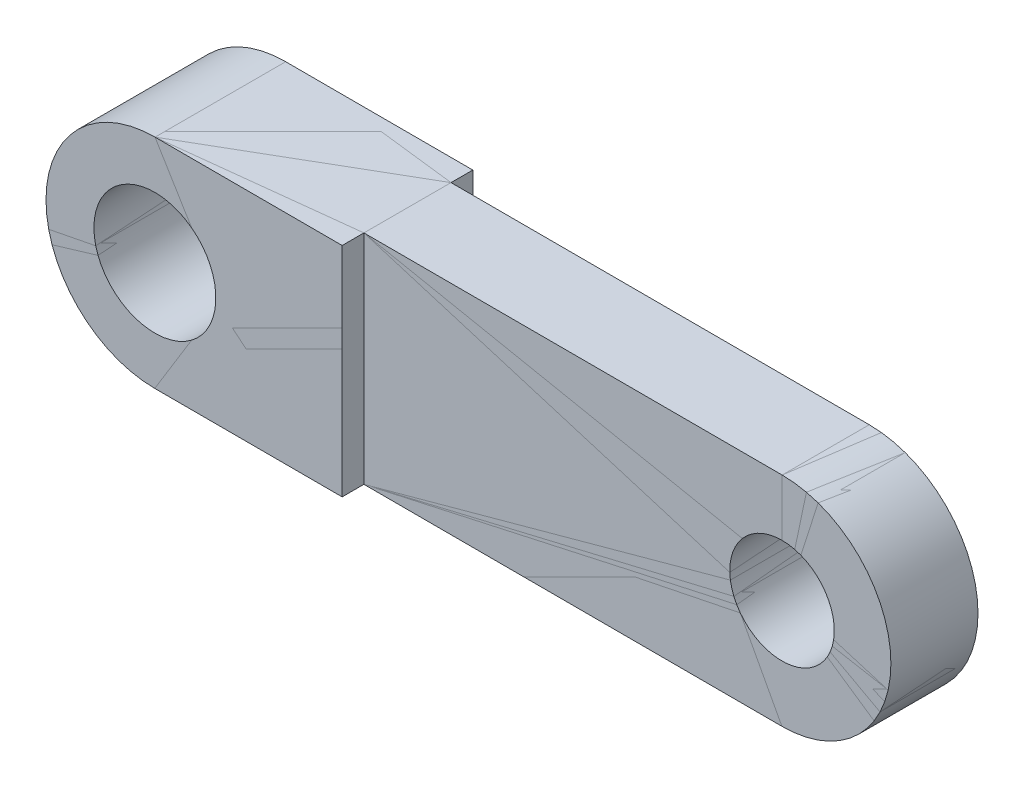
ISO-10303-21;
HEADER;
FILE_DESCRIPTION(('STEP AP214'),'2;1');
FILE_NAME('part.step','',(''),(''),'','','');
FILE_SCHEMA(('AUTOMOTIVE_DESIGN { 1 0 10303 214 1 1 1 1 }'));
ENDSEC;
DATA;
#1=APPLICATION_CONTEXT('core data for automotive mechanical design processes');
#2=APPLICATION_PROTOCOL_DEFINITION('international standard','automotive_design',2000,#1);
#3=PRODUCT_CONTEXT('',#1,'mechanical');
#4=PRODUCT('Part','Part','',(#3));
#5=PRODUCT_RELATED_PRODUCT_CATEGORY('part','',(#4));
#6=PRODUCT_DEFINITION_FORMATION('','',#4);
#7=PRODUCT_DEFINITION_CONTEXT('part definition',#1,'design');
#8=PRODUCT_DEFINITION('design','',#6,#7);
#9=PRODUCT_DEFINITION_SHAPE('','',#8);
#10=(LENGTH_UNIT() NAMED_UNIT(*) SI_UNIT(.MILLI.,.METRE.));
#11=(NAMED_UNIT(*) PLANE_ANGLE_UNIT() SI_UNIT($,.RADIAN.));
#12=(NAMED_UNIT(*) SI_UNIT($,.STERADIAN.) SOLID_ANGLE_UNIT());
#13=UNCERTAINTY_MEASURE_WITH_UNIT(LENGTH_MEASURE(1.E-05),#10,'distance_accuracy_value','');
#14=(GEOMETRIC_REPRESENTATION_CONTEXT(3) GLOBAL_UNCERTAINTY_ASSIGNED_CONTEXT((#13)) GLOBAL_UNIT_ASSIGNED_CONTEXT((#10,
#11,#12)) REPRESENTATION_CONTEXT('',''));
#15=CARTESIAN_POINT('',(0.,0.,0.));
#16=DIRECTION('',(0.,0.,1.));
#17=DIRECTION('',(1.,0.,0.));
#18=AXIS2_PLACEMENT_3D('',#15,#16,#17);
#19=CARTESIAN_POINT('',(-5.5,-0.094581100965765,-2.5));
#20=DIRECTION('',(0.,0.,-1.));
#21=DIRECTION('',(0.,1.,0.));
#22=AXIS2_PLACEMENT_3D('',#19,#20,#21);
#23=CYLINDRICAL_SURFACE('',#22,6.);
#24=CARTESIAN_POINT('',(-5.5,-0.0945811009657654,-12.5));
#25=DIRECTION('',(0.,0.,-1.));
#26=DIRECTION('',(0.,1.,0.));
#27=AXIS2_PLACEMENT_3D('',#24,#25,#26);
#28=CIRCLE('',#27,6.);
#29=CARTESIAN_POINT('',(-5.5,5.90541889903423,-12.5));
#30=VERTEX_POINT('',#29);
#31=EDGE_CURVE('P0_E352',#30,#30,#28,.T.);
#32=ORIENTED_EDGE('',*,*,#31,.T.);
#33=EDGE_LOOP('',(#32));
#34=FACE_BOUND('',#33,.T.);
#35=CARTESIAN_POINT('',(-5.5,-0.094581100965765,-2.5));
#36=DIRECTION('',(0.,0.,-1.));
#37=DIRECTION('',(0.,1.,0.));
#38=AXIS2_PLACEMENT_3D('',#35,#36,#37);
#39=CIRCLE('',#38,6.);
#40=CARTESIAN_POINT('',(-5.5,5.90541889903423,-2.5));
#41=VERTEX_POINT('',#40);
#42=EDGE_CURVE('P0_E430',#41,#41,#39,.F.);
#43=ORIENTED_EDGE('',*,*,#42,.T.);
#44=EDGE_LOOP('',(#43));
#45=FACE_BOUND('',#44,.T.);
#46=ADVANCED_FACE('P0_F348',(#34,#45),#23,.F.);
#47=CARTESIAN_POINT('',(-53.5,-12.529270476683,-15.));
#48=DIRECTION('',(-1.,0.,0.));
#49=DIRECTION('',(0.,0.,1.));
#50=AXIS2_PLACEMENT_3D('',#47,#48,#49);
#51=PLANE('',#50);
#52=DIRECTION('',(0.,-1.,0.));
#53=VECTOR('',#52,1.);
#54=CARTESIAN_POINT('',(-53.5,-17.779247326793,-12.5));
#55=LINE('',#54,#53);
#56=CARTESIAN_POINT('',(-53.5000000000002,12.4707526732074,-12.5000000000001));
#57=VERTEX_POINT('',#56);
#58=CARTESIAN_POINT('',(-53.4999999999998,-12.5292704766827,-12.5000000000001));
#59=VERTEX_POINT('',#58);
#60=EDGE_CURVE('P0_E408',#57,#59,#55,.T.);
#61=ORIENTED_EDGE('',*,*,#60,.T.);
#62=DIRECTION('',(0.,0.,1.));
#63=VECTOR('',#62,1.);
#64=CARTESIAN_POINT('',(-53.4999999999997,-12.5292704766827,-34.750032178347));
#65=LINE('',#64,#63);
#66=CARTESIAN_POINT('',(-53.4999999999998,-12.5292704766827,-15.0000000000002));
#67=VERTEX_POINT('',#66);
#68=EDGE_CURVE('P0_E433',#67,#59,#65,.T.);
#69=ORIENTED_EDGE('',*,*,#68,.F.);
#70=DIRECTION('',(0.,-1.,0.));
#71=VECTOR('',#70,1.);
#72=CARTESIAN_POINT('',(-53.5,-4.33,-15.));
#73=LINE('',#72,#71);
#74=CARTESIAN_POINT('',(-53.5000000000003,12.4707526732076,-15.0000000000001));
#75=VERTEX_POINT('',#74);
#76=EDGE_CURVE('P0_E415',#75,#67,#73,.T.);
#77=ORIENTED_EDGE('',*,*,#76,.F.);
#78=DIRECTION('',(0.,0.,-1.));
#79=VECTOR('',#78,1.);
#80=CARTESIAN_POINT('',(-53.5000000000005,12.4707526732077,-34.750032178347));
#81=LINE('',#80,#79);
#82=EDGE_CURVE('P0_E452',#57,#75,#81,.T.);
#83=ORIENTED_EDGE('',*,*,#82,.F.);
#84=EDGE_LOOP('',(#61,#69,#77,#83));
#85=FACE_BOUND('',#84,.T.);
#86=ADVANCED_FACE('P0_F434',(#85),#51,.F.);
#87=CARTESIAN_POINT('',(7.605,12.470752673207,-12.5));
#88=DIRECTION('',(0.,0.,1.));
#89=DIRECTION('',(-1.,0.,0.));
#90=AXIS2_PLACEMENT_3D('',#87,#88,#89);
#91=PLANE('',#90);
#92=ORIENTED_EDGE('',*,*,#31,.F.);
#93=EDGE_LOOP('',(#92));
#94=FACE_BOUND('',#93,.T.);
#95=CARTESIAN_POINT('',(-5.5,-0.094581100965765,-12.5));
#96=DIRECTION('',(0.,0.,1.));
#97=DIRECTION('',(1.,0.,0.));
#98=AXIS2_PLACEMENT_3D('',#95,#96,#97);
#99=CIRCLE('',#98,12.5000000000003);
#100=CARTESIAN_POINT('',(-5.48298902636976,12.4054073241,-12.5000000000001));
#101=VERTEX_POINT('',#100);
#102=CARTESIAN_POINT('',(-5.51701097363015,-12.594569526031,-12.5000000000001));
#103=VERTEX_POINT('',#102);
#104=EDGE_CURVE('P0_E402',#101,#103,#99,.F.);
#105=ORIENTED_EDGE('',*,*,#104,.T.);
#106=DIRECTION('',(0.999999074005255,-0.0013608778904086,0.));
#107=VECTOR('',#106,1.);
#108=CARTESIAN_POINT('',(-40.2670109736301,-12.5472789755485,-12.5000000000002));
#109=LINE('',#108,#107);
#110=EDGE_CURVE('P0_E436',#59,#103,#109,.T.);
#111=ORIENTED_EDGE('',*,*,#110,.F.);
#112=ORIENTED_EDGE('',*,*,#60,.F.);
#113=DIRECTION('',(-0.999999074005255,0.00136087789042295,0.));
#114=VECTOR('',#113,1.);
#115=CARTESIAN_POINT('',(-40.2329890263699,12.452697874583,-12.5000000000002));
#116=LINE('',#115,#114);
#117=EDGE_CURVE('P0_E456',#101,#57,#116,.T.);
#118=ORIENTED_EDGE('',*,*,#117,.F.);
#119=EDGE_LOOP('',(#105,#111,#112,#118));
#120=FACE_BOUND('',#119,.T.);
#121=ADVANCED_FACE('P0_F531',(#94,#120),#91,.F.);
#122=CARTESIAN_POINT('',(-5.5,-0.094581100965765,-12.5));
#123=DIRECTION('',(0.,0.,1.));
#124=DIRECTION('',(1.,0.,0.));
#125=AXIS2_PLACEMENT_3D('',#122,#123,#124);
#126=CYLINDRICAL_SURFACE('',#125,12.5000000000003);
#127=ORIENTED_EDGE('',*,*,#104,.F.);
#128=DIRECTION('',(0.,0.,-1.));
#129=VECTOR('',#128,1.);
#130=CARTESIAN_POINT('',(-5.4829890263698,12.4054073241,-34.750032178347));
#131=LINE('',#130,#129);
#132=CARTESIAN_POINT('',(-5.48298902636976,12.4054073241,-2.49999999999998));
#133=VERTEX_POINT('',#132);
#134=EDGE_CURVE('P0_E461',#133,#101,#131,.T.);
#135=ORIENTED_EDGE('',*,*,#134,.F.);
#136=CARTESIAN_POINT('',(-5.5,-0.094581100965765,-2.5));
#137=DIRECTION('',(0.,0.,1.));
#138=DIRECTION('',(1.,0.,0.));
#139=AXIS2_PLACEMENT_3D('',#136,#137,#138);
#140=CIRCLE('',#139,12.5000000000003);
#141=CARTESIAN_POINT('',(-5.51701097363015,-12.594569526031,-2.49999999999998));
#142=VERTEX_POINT('',#141);
#143=EDGE_CURVE('P0_E481',#133,#142,#140,.F.);
#144=ORIENTED_EDGE('',*,*,#143,.T.);
#145=DIRECTION('',(0.,0.,1.));
#146=VECTOR('',#145,1.);
#147=CARTESIAN_POINT('',(-5.5170109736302,-12.594569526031,-34.750032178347));
#148=LINE('',#147,#146);
#149=EDGE_CURVE('P0_E492',#103,#142,#148,.T.);
#150=ORIENTED_EDGE('',*,*,#149,.F.);
#151=EDGE_LOOP('',(#127,#135,#144,#150));
#152=FACE_BOUND('',#151,.T.);
#153=ADVANCED_FACE('P0_F530',(#152),#126,.T.);
#154=CARTESIAN_POINT('',(7.605,-13.199581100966,-2.5));
#155=DIRECTION('',(0.,0.,-1.));
#156=DIRECTION('',(-1.,0.,0.));
#157=AXIS2_PLACEMENT_3D('',#154,#155,#156);
#158=PLANE('',#157);
#159=ORIENTED_EDGE('',*,*,#42,.F.);
#160=EDGE_LOOP('',(#159));
#161=FACE_BOUND('',#160,.T.);
#162=DIRECTION('',(-0.999999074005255,0.0013608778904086,0.));
#163=VECTOR('',#162,1.);
#164=CARTESIAN_POINT('',(-40.2670109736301,-12.5472789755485,-2.49999999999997));
#165=LINE('',#164,#163);
#166=CARTESIAN_POINT('',(-53.5,-12.5292704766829,-2.49999999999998));
#167=VERTEX_POINT('',#166);
#168=EDGE_CURVE('P0_E495',#142,#167,#165,.T.);
#169=ORIENTED_EDGE('',*,*,#168,.F.);
#170=ORIENTED_EDGE('',*,*,#143,.F.);
#171=DIRECTION('',(0.999999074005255,-0.00136087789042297,0.));
#172=VECTOR('',#171,1.);
#173=CARTESIAN_POINT('',(-40.2329890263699,12.452697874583,-2.49999999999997));
#174=LINE('',#173,#172);
#175=CARTESIAN_POINT('',(-53.5000000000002,12.4707526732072,-2.49999999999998));
#176=VERTEX_POINT('',#175);
#177=EDGE_CURVE('P0_E429',#176,#133,#174,.T.);
#178=ORIENTED_EDGE('',*,*,#177,.F.);
#179=DIRECTION('',(0.,-1.,0.));
#180=VECTOR('',#179,1.);
#181=CARTESIAN_POINT('',(-53.5,-0.0292589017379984,-2.49999999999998));
#182=LINE('',#181,#180);
#183=EDGE_CURVE('P0_E502',#176,#167,#182,.T.);
#184=ORIENTED_EDGE('',*,*,#183,.T.);
#185=EDGE_LOOP('',(#169,#170,#178,#184));
#186=FACE_BOUND('',#185,.T.);
#187=ADVANCED_FACE('P0_F529',(#161,#186),#158,.F.);
#188=CARTESIAN_POINT('',(-87.84,12.84,-15.));
#189=DIRECTION('',(0.,0.,-1.));
#190=DIRECTION('',(1.,0.,0.));
#191=AXIS2_PLACEMENT_3D('',#188,#189,#190);
#192=PLANE('',#191);
#193=CARTESIAN_POINT('',(-75.,0.,-15.));
#194=DIRECTION('',(0.,0.,-1.));
#195=DIRECTION('',(-1.,0.,0.));
#196=AXIS2_PLACEMENT_3D('',#193,#194,#195);
#197=CIRCLE('',#196,6.99999999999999);
#198=CARTESIAN_POINT('',(-82.,0.,-15.));
#199=VERTEX_POINT('',#198);
#200=EDGE_CURVE('P0_E475',#199,#199,#197,.T.);
#201=ORIENTED_EDGE('',*,*,#200,.F.);
#202=EDGE_LOOP('',(#201));
#203=FACE_BOUND('',#202,.T.);
#204=CARTESIAN_POINT('',(-75.,0.,-15.));
#205=DIRECTION('',(0.,0.,1.));
#206=DIRECTION('',(0.,-1.,0.));
#207=AXIS2_PLACEMENT_3D('',#204,#205,#206);
#208=CIRCLE('',#207,12.5000000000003);
#209=CARTESIAN_POINT('',(-75.0170109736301,-12.499988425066,-15.0000000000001));
#210=VERTEX_POINT('',#209);
#211=CARTESIAN_POINT('',(-74.9829890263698,12.499988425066,-15.0000000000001));
#212=VERTEX_POINT('',#211);
#213=EDGE_CURVE('P0_E451',#210,#212,#208,.F.);
#214=ORIENTED_EDGE('',*,*,#213,.T.);
#215=DIRECTION('',(-0.999999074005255,0.00136087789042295,0.));
#216=VECTOR('',#215,1.);
#217=CARTESIAN_POINT('',(-40.2329890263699,12.452697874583,-15.0000000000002));
#218=LINE('',#217,#216);
#219=EDGE_CURVE('P0_E427',#75,#212,#218,.T.);
#220=ORIENTED_EDGE('',*,*,#219,.F.);
#221=ORIENTED_EDGE('',*,*,#76,.T.);
#222=DIRECTION('',(0.999999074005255,-0.00136087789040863,0.));
#223=VECTOR('',#222,1.);
#224=CARTESIAN_POINT('',(-40.2670109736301,-12.5472789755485,-15.0000000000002));
#225=LINE('',#224,#223);
#226=EDGE_CURVE('P0_E424',#210,#67,#225,.T.);
#227=ORIENTED_EDGE('',*,*,#226,.F.);
#228=EDGE_LOOP('',(#214,#220,#221,#227));
#229=FACE_BOUND('',#228,.T.);
#230=ADVANCED_FACE('P0_F422',(#203,#229),#192,.T.);
#231=CARTESIAN_POINT('',(-5.4829890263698,12.4054073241,0.));
#232=DIRECTION('',(0.00136087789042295,0.999999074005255,0.));
#233=DIRECTION('',(0.,0.,-1.));
#234=AXIS2_PLACEMENT_3D('',#231,#232,#233);
#235=PLANE('',#234);
#236=ORIENTED_EDGE('',*,*,#219,.T.);
#237=DIRECTION('',(0.,0.,1.));
#238=VECTOR('',#237,1.);
#239=CARTESIAN_POINT('',(-74.9829890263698,12.499988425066,-7.5));
#240=LINE('',#239,#238);
#241=CARTESIAN_POINT('',(-74.9829890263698,12.4999884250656,0.));
#242=VERTEX_POINT('',#241);
#243=EDGE_CURVE('P0_E441',#212,#242,#240,.T.);
#244=ORIENTED_EDGE('',*,*,#243,.T.);
#245=DIRECTION('',(-0.999999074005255,0.00136087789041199,0.));
#246=VECTOR('',#245,1.);
#247=CARTESIAN_POINT('',(-53.5,12.4707526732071,0.));
#248=LINE('',#247,#246);
#249=CARTESIAN_POINT('',(-53.5,12.4707526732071,0.));
#250=VERTEX_POINT('',#249);
#251=EDGE_CURVE('P0_E472',#250,#242,#248,.T.);
#252=ORIENTED_EDGE('',*,*,#251,.F.);
#253=DIRECTION('',(0.,0.,-1.));
#254=VECTOR('',#253,1.);
#255=CARTESIAN_POINT('',(-53.5,12.470752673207,-12.500011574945));
#256=LINE('',#255,#254);
#257=EDGE_CURVE('P0_E505',#250,#176,#256,.T.);
#258=ORIENTED_EDGE('',*,*,#257,.T.);
#259=ORIENTED_EDGE('',*,*,#177,.T.);
#260=ORIENTED_EDGE('',*,*,#134,.T.);
#261=ORIENTED_EDGE('',*,*,#117,.T.);
#262=ORIENTED_EDGE('',*,*,#82,.T.);
#263=EDGE_LOOP('',(#236,#244,#252,#258,#259,#260,#261,#262));
#264=FACE_BOUND('',#263,.T.);
#265=ADVANCED_FACE('P0_F524',(#264),#235,.T.);
#266=CARTESIAN_POINT('',(-75.,0.,-15.));
#267=DIRECTION('',(0.,0.,1.));
#268=DIRECTION('',(0.,-1.,0.));
#269=AXIS2_PLACEMENT_3D('',#266,#267,#268);
#270=CYLINDRICAL_SURFACE('',#269,12.5000000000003);
#271=ORIENTED_EDGE('',*,*,#243,.F.);
#272=ORIENTED_EDGE('',*,*,#213,.F.);
#273=DIRECTION('',(0.,0.,-1.));
#274=VECTOR('',#273,1.);
#275=CARTESIAN_POINT('',(-75.01701097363,-12.499988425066,-34.750032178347));
#276=LINE('',#275,#274);
#277=CARTESIAN_POINT('',(-75.0170109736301,-12.499988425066,0.));
#278=VERTEX_POINT('',#277);
#279=EDGE_CURVE('P0_E439',#278,#210,#276,.T.);
#280=ORIENTED_EDGE('',*,*,#279,.F.);
#281=CARTESIAN_POINT('',(-75.,0.,0.));
#282=DIRECTION('',(0.,0.,1.));
#283=DIRECTION('',(0.,-1.,0.));
#284=AXIS2_PLACEMENT_3D('',#281,#282,#283);
#285=CIRCLE('',#284,12.5000000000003);
#286=EDGE_CURVE('P0_E469',#242,#278,#285,.T.);
#287=ORIENTED_EDGE('',*,*,#286,.F.);
#288=EDGE_LOOP('',(#271,#272,#280,#287));
#289=FACE_BOUND('',#288,.T.);
#290=ADVANCED_FACE('P0_F559',(#289),#270,.T.);
#291=CARTESIAN_POINT('',(-75.01701097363,-12.499988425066,0.));
#292=DIRECTION('',(-0.0013608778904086,-0.999999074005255,0.));
#293=DIRECTION('',(0.,0.,-1.));
#294=AXIS2_PLACEMENT_3D('',#291,#292,#293);
#295=PLANE('',#294);
#296=ORIENTED_EDGE('',*,*,#168,.T.);
#297=DIRECTION('',(0.,0.,1.));
#298=VECTOR('',#297,1.);
#299=CARTESIAN_POINT('',(-53.5,-12.529270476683,-12.500011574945));
#300=LINE('',#299,#298);
#301=CARTESIAN_POINT('',(-53.5,-12.529270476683,0.));
#302=VERTEX_POINT('',#301);
#303=EDGE_CURVE('P0_E367',#167,#302,#300,.T.);
#304=ORIENTED_EDGE('',*,*,#303,.T.);
#305=DIRECTION('',(0.999999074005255,-0.00136087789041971,0.));
#306=VECTOR('',#305,1.);
#307=CARTESIAN_POINT('',(-75.0170109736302,-12.499988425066,0.));
#308=LINE('',#307,#306);
#309=EDGE_CURVE('P0_E466',#278,#302,#308,.T.);
#310=ORIENTED_EDGE('',*,*,#309,.F.);
#311=ORIENTED_EDGE('',*,*,#279,.T.);
#312=ORIENTED_EDGE('',*,*,#226,.T.);
#313=ORIENTED_EDGE('',*,*,#68,.T.);
#314=ORIENTED_EDGE('',*,*,#110,.T.);
#315=ORIENTED_EDGE('',*,*,#149,.T.);
#316=EDGE_LOOP('',(#296,#304,#310,#311,#312,#313,#314,#315));
#317=FACE_BOUND('',#316,.T.);
#318=ADVANCED_FACE('P0_F438',(#317),#295,.T.);
#319=CARTESIAN_POINT('',(-53.5,12.470752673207,0.));
#320=DIRECTION('',(-1.,0.,0.));
#321=DIRECTION('',(0.,0.,-1.));
#322=AXIS2_PLACEMENT_3D('',#319,#320,#321);
#323=PLANE('',#322);
#324=ORIENTED_EDGE('',*,*,#303,.F.);
#325=ORIENTED_EDGE('',*,*,#183,.F.);
#326=ORIENTED_EDGE('',*,*,#257,.F.);
#327=DIRECTION('',(0.,1.,0.));
#328=VECTOR('',#327,1.);
#329=CARTESIAN_POINT('',(-53.5,4.470729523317,0.));
#330=LINE('',#329,#328);
#331=EDGE_CURVE('P0_E358',#302,#250,#330,.T.);
#332=ORIENTED_EDGE('',*,*,#331,.F.);
#333=EDGE_LOOP('',(#324,#325,#326,#332));
#334=FACE_BOUND('',#333,.T.);
#335=ADVANCED_FACE('P0_F521',(#334),#323,.F.);
#336=CARTESIAN_POINT('',(-75.,0.,0.));
#337=DIRECTION('',(0.,0.,-1.));
#338=DIRECTION('',(-1.,0.,0.));
#339=AXIS2_PLACEMENT_3D('',#336,#337,#338);
#340=CYLINDRICAL_SURFACE('',#339,6.99999999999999);
#341=ORIENTED_EDGE('',*,*,#200,.T.);
#342=EDGE_LOOP('',(#341));
#343=FACE_BOUND('',#342,.T.);
#344=CARTESIAN_POINT('',(-75.,0.,0.));
#345=DIRECTION('',(0.,0.,-1.));
#346=DIRECTION('',(-1.,0.,0.));
#347=AXIS2_PLACEMENT_3D('',#344,#345,#346);
#348=CIRCLE('',#347,6.99999999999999);
#349=CARTESIAN_POINT('',(-82.,0.,0.));
#350=VERTEX_POINT('',#349);
#351=EDGE_CURVE('P0_E11',#350,#350,#348,.T.);
#352=ORIENTED_EDGE('',*,*,#351,.F.);
#353=EDGE_LOOP('',(#352));
#354=FACE_BOUND('',#353,.T.);
#355=ADVANCED_FACE('P0_F544',(#343,#354),#340,.F.);
#356=CARTESIAN_POINT('',(-87.84,-12.529270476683,0.));
#357=DIRECTION('',(0.,0.,1.));
#358=DIRECTION('',(1.,0.,0.));
#359=AXIS2_PLACEMENT_3D('',#356,#357,#358);
#360=PLANE('',#359);
#361=ORIENTED_EDGE('',*,*,#351,.T.);
#362=EDGE_LOOP('',(#361));
#363=FACE_BOUND('',#362,.T.);
#364=ORIENTED_EDGE('',*,*,#309,.T.);
#365=ORIENTED_EDGE('',*,*,#331,.T.);
#366=ORIENTED_EDGE('',*,*,#251,.T.);
#367=ORIENTED_EDGE('',*,*,#286,.T.);
#368=EDGE_LOOP('',(#364,#365,#366,#367));
#369=FACE_BOUND('',#368,.T.);
#370=ADVANCED_FACE('P0_F350',(#363,#369),#360,.T.);
#371=CLOSED_SHELL('',(#46,#86,#121,#153,#187,#230,#265,#290,#318,#335,#355,#370));
#372=MANIFOLD_SOLID_BREP('P0_B2',#371);
#373=CARTESIAN_POINT('',(-5.5,-0.094581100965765,-2.5));
#374=DIRECTION('',(0.,0.,-1.));
#375=DIRECTION('',(0.,1.,0.));
#376=AXIS2_PLACEMENT_3D('',#373,#374,#375);
#377=CYLINDRICAL_SURFACE('',#376,6.);
#378=CARTESIAN_POINT('',(-5.5,-0.0945811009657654,-12.5));
#379=DIRECTION('',(0.,0.,-1.));
#380=DIRECTION('',(0.,1.,0.));
#381=AXIS2_PLACEMENT_3D('',#378,#379,#380);
#382=CIRCLE('',#381,6.);
#383=CARTESIAN_POINT('',(-5.5,5.90541889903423,-12.5));
#384=VERTEX_POINT('',#383);
#385=EDGE_CURVE('P1_E19',#384,#384,#382,.T.);
#386=ORIENTED_EDGE('',*,*,#385,.T.);
#387=EDGE_LOOP('',(#386));
#388=FACE_BOUND('',#387,.T.);
#389=CARTESIAN_POINT('',(-5.5,-0.094581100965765,-2.5));
#390=DIRECTION('',(0.,0.,-1.));
#391=DIRECTION('',(0.,1.,0.));
#392=AXIS2_PLACEMENT_3D('',#389,#390,#391);
#393=CIRCLE('',#392,6.);
#394=CARTESIAN_POINT('',(-5.5,5.90541889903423,-2.5));
#395=VERTEX_POINT('',#394);
#396=EDGE_CURVE('P1_E97',#395,#395,#393,.F.);
#397=ORIENTED_EDGE('',*,*,#396,.T.);
#398=EDGE_LOOP('',(#397));
#399=FACE_BOUND('',#398,.T.);
#400=ADVANCED_FACE('P1_F15',(#388,#399),#377,.F.);
#401=CARTESIAN_POINT('',(-53.5,-12.529270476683,-15.));
#402=DIRECTION('',(-1.,0.,0.));
#403=DIRECTION('',(0.,0.,1.));
#404=AXIS2_PLACEMENT_3D('',#401,#402,#403);
#405=PLANE('',#404);
#406=DIRECTION('',(0.,-1.,0.));
#407=VECTOR('',#406,1.);
#408=CARTESIAN_POINT('',(-53.5,-17.779247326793,-12.5));
#409=LINE('',#408,#407);
#410=CARTESIAN_POINT('',(-53.5000000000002,12.4707526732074,-12.5000000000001));
#411=VERTEX_POINT('',#410);
#412=CARTESIAN_POINT('',(-53.4999999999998,-12.5292704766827,-12.5000000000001));
#413=VERTEX_POINT('',#412);
#414=EDGE_CURVE('P1_E75',#411,#413,#409,.T.);
#415=ORIENTED_EDGE('',*,*,#414,.T.);
#416=DIRECTION('',(0.,0.,1.));
#417=VECTOR('',#416,1.);
#418=CARTESIAN_POINT('',(-53.4999999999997,-12.5292704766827,-34.750032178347));
#419=LINE('',#418,#417);
#420=CARTESIAN_POINT('',(-53.4999999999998,-12.5292704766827,-15.0000000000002));
#421=VERTEX_POINT('',#420);
#422=EDGE_CURVE('P1_E100',#421,#413,#419,.T.);
#423=ORIENTED_EDGE('',*,*,#422,.F.);
#424=DIRECTION('',(0.,-1.,0.));
#425=VECTOR('',#424,1.);
#426=CARTESIAN_POINT('',(-53.5,-4.33,-15.));
#427=LINE('',#426,#425);
#428=CARTESIAN_POINT('',(-53.5000000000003,12.4707526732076,-15.0000000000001));
#429=VERTEX_POINT('',#428);
#430=EDGE_CURVE('P1_E82',#429,#421,#427,.T.);
#431=ORIENTED_EDGE('',*,*,#430,.F.);
#432=DIRECTION('',(0.,0.,-1.));
#433=VECTOR('',#432,1.);
#434=CARTESIAN_POINT('',(-53.5000000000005,12.4707526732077,-34.750032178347));
#435=LINE('',#434,#433);
#436=EDGE_CURVE('P1_E119',#411,#429,#435,.T.);
#437=ORIENTED_EDGE('',*,*,#436,.F.);
#438=EDGE_LOOP('',(#415,#423,#431,#437));
#439=FACE_BOUND('',#438,.T.);
#440=ADVANCED_FACE('P1_F101',(#439),#405,.F.);
#441=CARTESIAN_POINT('',(7.605,12.470752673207,-12.5));
#442=DIRECTION('',(0.,0.,1.));
#443=DIRECTION('',(-1.,0.,0.));
#444=AXIS2_PLACEMENT_3D('',#441,#442,#443);
#445=PLANE('',#444);
#446=ORIENTED_EDGE('',*,*,#385,.F.);
#447=EDGE_LOOP('',(#446));
#448=FACE_BOUND('',#447,.T.);
#449=CARTESIAN_POINT('',(-5.5,-0.094581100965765,-12.5));
#450=DIRECTION('',(0.,0.,1.));
#451=DIRECTION('',(1.,0.,0.));
#452=AXIS2_PLACEMENT_3D('',#449,#450,#451);
#453=CIRCLE('',#452,12.5000000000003);
#454=CARTESIAN_POINT('',(-5.48298902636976,12.4054073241,-12.5000000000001));
#455=VERTEX_POINT('',#454);
#456=CARTESIAN_POINT('',(-5.51701097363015,-12.594569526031,-12.5000000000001));
#457=VERTEX_POINT('',#456);
#458=EDGE_CURVE('P1_E69',#455,#457,#453,.F.);
#459=ORIENTED_EDGE('',*,*,#458,.T.);
#460=DIRECTION('',(0.999999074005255,-0.0013608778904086,0.));
#461=VECTOR('',#460,1.);
#462=CARTESIAN_POINT('',(-40.2670109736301,-12.5472789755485,-12.5000000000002));
#463=LINE('',#462,#461);
#464=EDGE_CURVE('P1_E103',#413,#457,#463,.T.);
#465=ORIENTED_EDGE('',*,*,#464,.F.);
#466=ORIENTED_EDGE('',*,*,#414,.F.);
#467=DIRECTION('',(-0.999999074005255,0.00136087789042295,0.));
#468=VECTOR('',#467,1.);
#469=CARTESIAN_POINT('',(-40.2329890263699,12.452697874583,-12.5000000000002));
#470=LINE('',#469,#468);
#471=EDGE_CURVE('P1_E123',#455,#411,#470,.T.);
#472=ORIENTED_EDGE('',*,*,#471,.F.);
#473=EDGE_LOOP('',(#459,#465,#466,#472));
#474=FACE_BOUND('',#473,.T.);
#475=ADVANCED_FACE('P1_F198',(#448,#474),#445,.F.);
#476=CARTESIAN_POINT('',(-5.5,-0.094581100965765,-12.5));
#477=DIRECTION('',(0.,0.,1.));
#478=DIRECTION('',(1.,0.,0.));
#479=AXIS2_PLACEMENT_3D('',#476,#477,#478);
#480=CYLINDRICAL_SURFACE('',#479,12.5000000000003);
#481=ORIENTED_EDGE('',*,*,#458,.F.);
#482=DIRECTION('',(0.,0.,-1.));
#483=VECTOR('',#482,1.);
#484=CARTESIAN_POINT('',(-5.4829890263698,12.4054073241,-34.750032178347));
#485=LINE('',#484,#483);
#486=CARTESIAN_POINT('',(-5.48298902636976,12.4054073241,-2.49999999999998));
#487=VERTEX_POINT('',#486);
#488=EDGE_CURVE('P1_E128',#487,#455,#485,.T.);
#489=ORIENTED_EDGE('',*,*,#488,.F.);
#490=CARTESIAN_POINT('',(-5.5,-0.094581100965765,-2.5));
#491=DIRECTION('',(0.,0.,1.));
#492=DIRECTION('',(1.,0.,0.));
#493=AXIS2_PLACEMENT_3D('',#490,#491,#492);
#494=CIRCLE('',#493,12.5000000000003);
#495=CARTESIAN_POINT('',(-5.51701097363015,-12.594569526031,-2.49999999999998));
#496=VERTEX_POINT('',#495);
#497=EDGE_CURVE('P1_E148',#487,#496,#494,.F.);
#498=ORIENTED_EDGE('',*,*,#497,.T.);
#499=DIRECTION('',(0.,0.,1.));
#500=VECTOR('',#499,1.);
#501=CARTESIAN_POINT('',(-5.5170109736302,-12.594569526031,-34.750032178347));
#502=LINE('',#501,#500);
#503=EDGE_CURVE('P1_E159',#457,#496,#502,.T.);
#504=ORIENTED_EDGE('',*,*,#503,.F.);
#505=EDGE_LOOP('',(#481,#489,#498,#504));
#506=FACE_BOUND('',#505,.T.);
#507=ADVANCED_FACE('P1_F197',(#506),#480,.T.);
#508=CARTESIAN_POINT('',(7.605,-13.199581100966,-2.5));
#509=DIRECTION('',(0.,0.,-1.));
#510=DIRECTION('',(-1.,0.,0.));
#511=AXIS2_PLACEMENT_3D('',#508,#509,#510);
#512=PLANE('',#511);
#513=ORIENTED_EDGE('',*,*,#396,.F.);
#514=EDGE_LOOP('',(#513));
#515=FACE_BOUND('',#514,.T.);
#516=DIRECTION('',(-0.999999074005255,0.0013608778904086,0.));
#517=VECTOR('',#516,1.);
#518=CARTESIAN_POINT('',(-40.2670109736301,-12.5472789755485,-2.49999999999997));
#519=LINE('',#518,#517);
#520=CARTESIAN_POINT('',(-53.5,-12.5292704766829,-2.49999999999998));
#521=VERTEX_POINT('',#520);
#522=EDGE_CURVE('P1_E162',#496,#521,#519,.T.);
#523=ORIENTED_EDGE('',*,*,#522,.F.);
#524=ORIENTED_EDGE('',*,*,#497,.F.);
#525=DIRECTION('',(0.999999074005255,-0.00136087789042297,0.));
#526=VECTOR('',#525,1.);
#527=CARTESIAN_POINT('',(-40.2329890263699,12.452697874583,-2.49999999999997));
#528=LINE('',#527,#526);
#529=CARTESIAN_POINT('',(-53.5000000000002,12.4707526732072,-2.49999999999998));
#530=VERTEX_POINT('',#529);
#531=EDGE_CURVE('P1_E96',#530,#487,#528,.T.);
#532=ORIENTED_EDGE('',*,*,#531,.F.);
#533=DIRECTION('',(0.,-1.,0.));
#534=VECTOR('',#533,1.);
#535=CARTESIAN_POINT('',(-53.5,-0.0292589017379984,-2.49999999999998));
#536=LINE('',#535,#534);
#537=EDGE_CURVE('P1_E169',#530,#521,#536,.T.);
#538=ORIENTED_EDGE('',*,*,#537,.T.);
#539=EDGE_LOOP('',(#523,#524,#532,#538));
#540=FACE_BOUND('',#539,.T.);
#541=ADVANCED_FACE('P1_F196',(#515,#540),#512,.F.);
#542=CARTESIAN_POINT('',(-87.84,12.84,-15.));
#543=DIRECTION('',(0.,0.,-1.));
#544=DIRECTION('',(1.,0.,0.));
#545=AXIS2_PLACEMENT_3D('',#542,#543,#544);
#546=PLANE('',#545);
#547=CARTESIAN_POINT('',(-75.,0.,-15.));
#548=DIRECTION('',(0.,0.,-1.));
#549=DIRECTION('',(-1.,0.,0.));
#550=AXIS2_PLACEMENT_3D('',#547,#548,#549);
#551=CIRCLE('',#550,6.99999999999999);
#552=CARTESIAN_POINT('',(-82.,0.,-15.));
#553=VERTEX_POINT('',#552);
#554=EDGE_CURVE('P1_E142',#553,#553,#551,.T.);
#555=ORIENTED_EDGE('',*,*,#554,.F.);
#556=EDGE_LOOP('',(#555));
#557=FACE_BOUND('',#556,.T.);
#558=CARTESIAN_POINT('',(-75.,0.,-15.));
#559=DIRECTION('',(0.,0.,1.));
#560=DIRECTION('',(0.,-1.,0.));
#561=AXIS2_PLACEMENT_3D('',#558,#559,#560);
#562=CIRCLE('',#561,12.5000000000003);
#563=CARTESIAN_POINT('',(-75.0170109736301,-12.499988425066,-15.0000000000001));
#564=VERTEX_POINT('',#563);
#565=CARTESIAN_POINT('',(-74.9829890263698,12.499988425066,-15.0000000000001));
#566=VERTEX_POINT('',#565);
#567=EDGE_CURVE('P1_E118',#564,#566,#562,.F.);
#568=ORIENTED_EDGE('',*,*,#567,.T.);
#569=DIRECTION('',(-0.999999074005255,0.00136087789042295,0.));
#570=VECTOR('',#569,1.);
#571=CARTESIAN_POINT('',(-40.2329890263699,12.452697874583,-15.0000000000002));
#572=LINE('',#571,#570);
#573=EDGE_CURVE('P1_E94',#429,#566,#572,.T.);
#574=ORIENTED_EDGE('',*,*,#573,.F.);
#575=ORIENTED_EDGE('',*,*,#430,.T.);
#576=DIRECTION('',(0.999999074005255,-0.00136087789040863,0.));
#577=VECTOR('',#576,1.);
#578=CARTESIAN_POINT('',(-40.2670109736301,-12.5472789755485,-15.0000000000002));
#579=LINE('',#578,#577);
#580=EDGE_CURVE('P1_E91',#564,#421,#579,.T.);
#581=ORIENTED_EDGE('',*,*,#580,.F.);
#582=EDGE_LOOP('',(#568,#574,#575,#581));
#583=FACE_BOUND('',#582,.T.);
#584=ADVANCED_FACE('P1_F89',(#557,#583),#546,.T.);
#585=CARTESIAN_POINT('',(-5.4829890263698,12.4054073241,0.));
#586=DIRECTION('',(0.00136087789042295,0.999999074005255,0.));
#587=DIRECTION('',(0.,0.,-1.));
#588=AXIS2_PLACEMENT_3D('',#585,#586,#587);
#589=PLANE('',#588);
#590=ORIENTED_EDGE('',*,*,#573,.T.);
#591=DIRECTION('',(0.,0.,1.));
#592=VECTOR('',#591,1.);
#593=CARTESIAN_POINT('',(-74.9829890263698,12.499988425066,-7.5));
#594=LINE('',#593,#592);
#595=CARTESIAN_POINT('',(-74.9829890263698,12.4999884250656,0.));
#596=VERTEX_POINT('',#595);
#597=EDGE_CURVE('P1_E108',#566,#596,#594,.T.);
#598=ORIENTED_EDGE('',*,*,#597,.T.);
#599=DIRECTION('',(-0.999999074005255,0.00136087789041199,0.));
#600=VECTOR('',#599,1.);
#601=CARTESIAN_POINT('',(-53.5,12.4707526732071,0.));
#602=LINE('',#601,#600);
#603=CARTESIAN_POINT('',(-53.5,12.4707526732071,0.));
#604=VERTEX_POINT('',#603);
#605=EDGE_CURVE('P1_E139',#604,#596,#602,.T.);
#606=ORIENTED_EDGE('',*,*,#605,.F.);
#607=DIRECTION('',(0.,0.,-1.));
#608=VECTOR('',#607,1.);
#609=CARTESIAN_POINT('',(-53.5,12.470752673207,-12.500011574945));
#610=LINE('',#609,#608);
#611=EDGE_CURVE('P1_E172',#604,#530,#610,.T.);
#612=ORIENTED_EDGE('',*,*,#611,.T.);
#613=ORIENTED_EDGE('',*,*,#531,.T.);
#614=ORIENTED_EDGE('',*,*,#488,.T.);
#615=ORIENTED_EDGE('',*,*,#471,.T.);
#616=ORIENTED_EDGE('',*,*,#436,.T.);
#617=EDGE_LOOP('',(#590,#598,#606,#612,#613,#614,#615,#616));
#618=FACE_BOUND('',#617,.T.);
#619=ADVANCED_FACE('P1_F191',(#618),#589,.T.);
#620=CARTESIAN_POINT('',(-75.,0.,-15.));
#621=DIRECTION('',(0.,0.,1.));
#622=DIRECTION('',(0.,-1.,0.));
#623=AXIS2_PLACEMENT_3D('',#620,#621,#622);
#624=CYLINDRICAL_SURFACE('',#623,12.5000000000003);
#625=ORIENTED_EDGE('',*,*,#597,.F.);
#626=ORIENTED_EDGE('',*,*,#567,.F.);
#627=DIRECTION('',(0.,0.,-1.));
#628=VECTOR('',#627,1.);
#629=CARTESIAN_POINT('',(-75.01701097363,-12.499988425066,-34.750032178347));
#630=LINE('',#629,#628);
#631=CARTESIAN_POINT('',(-75.0170109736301,-12.499988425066,0.));
#632=VERTEX_POINT('',#631);
#633=EDGE_CURVE('P1_E106',#632,#564,#630,.T.);
#634=ORIENTED_EDGE('',*,*,#633,.F.);
#635=CARTESIAN_POINT('',(-75.,0.,0.));
#636=DIRECTION('',(0.,0.,1.));
#637=DIRECTION('',(0.,-1.,0.));
#638=AXIS2_PLACEMENT_3D('',#635,#636,#637);
#639=CIRCLE('',#638,12.5000000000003);
#640=EDGE_CURVE('P1_E136',#596,#632,#639,.T.);
#641=ORIENTED_EDGE('',*,*,#640,.F.);
#642=EDGE_LOOP('',(#625,#626,#634,#641));
#643=FACE_BOUND('',#642,.T.);
#644=ADVANCED_FACE('P1_F221',(#643),#624,.T.);
#645=CARTESIAN_POINT('',(-75.01701097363,-12.499988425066,0.));
#646=DIRECTION('',(-0.0013608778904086,-0.999999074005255,0.));
#647=DIRECTION('',(0.,0.,-1.));
#648=AXIS2_PLACEMENT_3D('',#645,#646,#647);
#649=PLANE('',#648);
#650=ORIENTED_EDGE('',*,*,#522,.T.);
#651=DIRECTION('',(0.,0.,1.));
#652=VECTOR('',#651,1.);
#653=CARTESIAN_POINT('',(-53.5,-12.529270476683,-12.500011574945));
#654=LINE('',#653,#652);
#655=CARTESIAN_POINT('',(-53.5,-12.529270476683,0.));
#656=VERTEX_POINT('',#655);
#657=EDGE_CURVE('P1_E34',#521,#656,#654,.T.);
#658=ORIENTED_EDGE('',*,*,#657,.T.);
#659=DIRECTION('',(0.999999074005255,-0.00136087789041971,0.));
#660=VECTOR('',#659,1.);
#661=CARTESIAN_POINT('',(-75.0170109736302,-12.499988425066,0.));
#662=LINE('',#661,#660);
#663=EDGE_CURVE('P1_E133',#632,#656,#662,.T.);
#664=ORIENTED_EDGE('',*,*,#663,.F.);
#665=ORIENTED_EDGE('',*,*,#633,.T.);
#666=ORIENTED_EDGE('',*,*,#580,.T.);
#667=ORIENTED_EDGE('',*,*,#422,.T.);
#668=ORIENTED_EDGE('',*,*,#464,.T.);
#669=ORIENTED_EDGE('',*,*,#503,.T.);
#670=EDGE_LOOP('',(#650,#658,#664,#665,#666,#667,#668,#669));
#671=FACE_BOUND('',#670,.T.);
#672=ADVANCED_FACE('P1_F105',(#671),#649,.T.);
#673=CARTESIAN_POINT('',(-53.5,12.470752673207,0.));
#674=DIRECTION('',(-1.,0.,0.));
#675=DIRECTION('',(0.,0.,-1.));
#676=AXIS2_PLACEMENT_3D('',#673,#674,#675);
#677=PLANE('',#676);
#678=ORIENTED_EDGE('',*,*,#657,.F.);
#679=ORIENTED_EDGE('',*,*,#537,.F.);
#680=ORIENTED_EDGE('',*,*,#611,.F.);
#681=DIRECTION('',(0.,1.,0.));
#682=VECTOR('',#681,1.);
#683=CARTESIAN_POINT('',(-53.5,4.470729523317,0.));
#684=LINE('',#683,#682);
#685=EDGE_CURVE('P1_E25',#656,#604,#684,.T.);
#686=ORIENTED_EDGE('',*,*,#685,.F.);
#687=EDGE_LOOP('',(#678,#679,#680,#686));
#688=FACE_BOUND('',#687,.T.);
#689=ADVANCED_FACE('P1_F188',(#688),#677,.F.);
#690=CARTESIAN_POINT('',(-75.,0.,0.));
#691=DIRECTION('',(0.,0.,-1.));
#692=DIRECTION('',(-1.,0.,0.));
#693=AXIS2_PLACEMENT_3D('',#690,#691,#692);
#694=CYLINDRICAL_SURFACE('',#693,6.99999999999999);
#695=ORIENTED_EDGE('',*,*,#554,.T.);
#696=EDGE_LOOP('',(#695));
#697=FACE_BOUND('',#696,.T.);
#698=CARTESIAN_POINT('',(-75.,0.,0.));
#699=DIRECTION('',(0.,0.,-1.));
#700=DIRECTION('',(-1.,0.,0.));
#701=AXIS2_PLACEMENT_3D('',#698,#699,#700);
#702=CIRCLE('',#701,6.99999999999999);
#703=CARTESIAN_POINT('',(-82.,0.,0.));
#704=VERTEX_POINT('',#703);
#705=EDGE_CURVE('P1_E10',#704,#704,#702,.T.);
#706=ORIENTED_EDGE('',*,*,#705,.F.);
#707=EDGE_LOOP('',(#706));
#708=FACE_BOUND('',#707,.T.);
#709=ADVANCED_FACE('P1_F210',(#697,#708),#694,.F.);
#710=CARTESIAN_POINT('',(-87.84,-12.529270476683,0.));
#711=DIRECTION('',(0.,0.,1.));
#712=DIRECTION('',(1.,0.,0.));
#713=AXIS2_PLACEMENT_3D('',#710,#711,#712);
#714=PLANE('',#713);
#715=ORIENTED_EDGE('',*,*,#705,.T.);
#716=EDGE_LOOP('',(#715));
#717=FACE_BOUND('',#716,.T.);
#718=ORIENTED_EDGE('',*,*,#663,.T.);
#719=ORIENTED_EDGE('',*,*,#685,.T.);
#720=ORIENTED_EDGE('',*,*,#605,.T.);
#721=ORIENTED_EDGE('',*,*,#640,.T.);
#722=EDGE_LOOP('',(#718,#719,#720,#721));
#723=FACE_BOUND('',#722,.T.);
#724=ADVANCED_FACE('P1_F17',(#717,#723),#714,.T.);
#725=CLOSED_SHELL('',(#400,#440,#475,#507,#541,#584,#619,#644,#672,#689,#709,#724));
#726=MANIFOLD_SOLID_BREP('P1_B1',#725);
#727=ADVANCED_BREP_SHAPE_REPRESENTATION('',(#18,#372,#726),#14);
#728=SHAPE_DEFINITION_REPRESENTATION(#9,#727);
ENDSEC;
END-ISO-10303-21;
